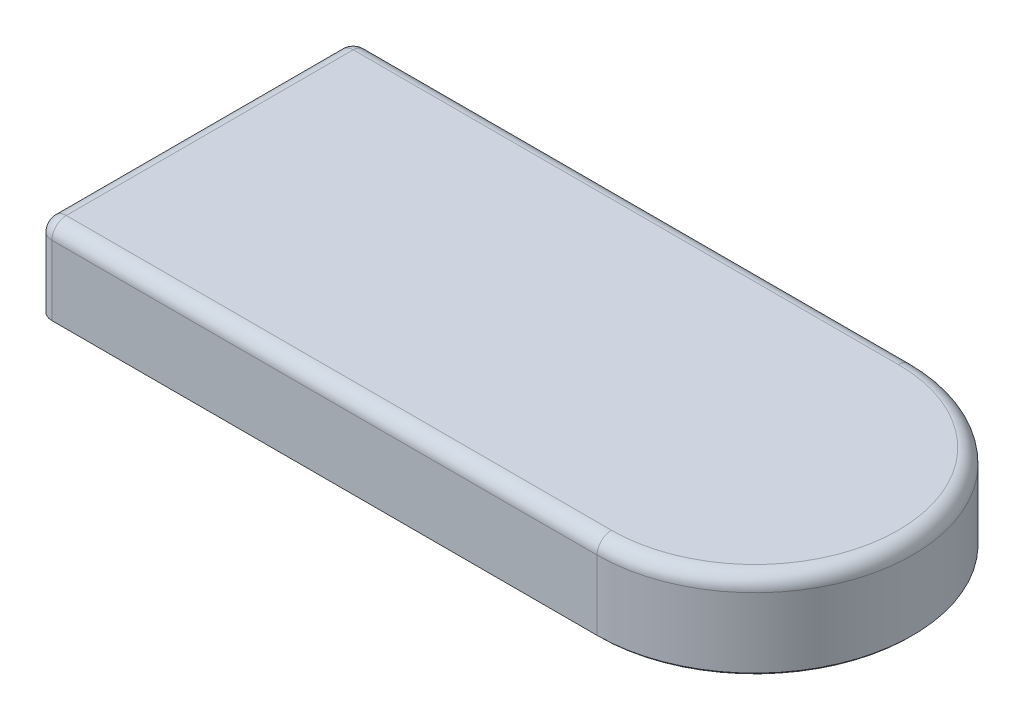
ISO-10303-21;
HEADER;
FILE_DESCRIPTION(('STEP AP214'),'2;1');
FILE_NAME('part.step','',(''),(''),'','','');
FILE_SCHEMA(('AUTOMOTIVE_DESIGN { 1 0 10303 214 1 1 1 1 }'));
ENDSEC;
DATA;
#1=APPLICATION_CONTEXT('core data for automotive mechanical design processes');
#2=APPLICATION_PROTOCOL_DEFINITION('international standard','automotive_design',2000,#1);
#3=PRODUCT_CONTEXT('',#1,'mechanical');
#4=PRODUCT('Part','Part','',(#3));
#5=PRODUCT_RELATED_PRODUCT_CATEGORY('part','',(#4));
#6=PRODUCT_DEFINITION_FORMATION('','',#4);
#7=PRODUCT_DEFINITION_CONTEXT('part definition',#1,'design');
#8=PRODUCT_DEFINITION('design','',#6,#7);
#9=PRODUCT_DEFINITION_SHAPE('','',#8);
#10=(LENGTH_UNIT() NAMED_UNIT(*) SI_UNIT(.MILLI.,.METRE.));
#11=(NAMED_UNIT(*) PLANE_ANGLE_UNIT() SI_UNIT($,.RADIAN.));
#12=(NAMED_UNIT(*) SI_UNIT($,.STERADIAN.) SOLID_ANGLE_UNIT());
#13=UNCERTAINTY_MEASURE_WITH_UNIT(LENGTH_MEASURE(1.E-05),#10,'distance_accuracy_value','');
#14=(GEOMETRIC_REPRESENTATION_CONTEXT(3) GLOBAL_UNCERTAINTY_ASSIGNED_CONTEXT((#13)) GLOBAL_UNIT_ASSIGNED_CONTEXT((#10,
#11,#12)) REPRESENTATION_CONTEXT('',''));
#15=CARTESIAN_POINT('',(0.,0.,0.));
#16=DIRECTION('',(0.,0.,1.));
#17=DIRECTION('',(1.,0.,0.));
#18=AXIS2_PLACEMENT_3D('',#15,#16,#17);
#19=CARTESIAN_POINT('',(78.,12.,-22.));
#20=DIRECTION('',(0.,-1.,0.));
#21=DIRECTION('',(0.,0.,-1.));
#22=AXIS2_PLACEMENT_3D('',#19,#20,#21);
#23=CYLINDRICAL_SURFACE('',#22,22.);
#24=DIRECTION('',(0.,-1.,0.));
#25=VECTOR('',#24,1.);
#26=CARTESIAN_POINT('',(78.,12.,0.));
#27=LINE('',#26,#25);
#28=CARTESIAN_POINT('',(78.,10.,0.));
#29=VERTEX_POINT('',#28);
#30=CARTESIAN_POINT('',(78.,0.299999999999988,0.));
#31=VERTEX_POINT('',#30);
#32=EDGE_CURVE('E187',#29,#31,#27,.T.);
#33=ORIENTED_EDGE('',*,*,#32,.T.);
#34=CARTESIAN_POINT('',(78.,0.299999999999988,-22.));
#35=DIRECTION('',(0.,-1.,0.));
#36=DIRECTION('',(0.,0.,-1.));
#37=AXIS2_PLACEMENT_3D('',#34,#35,#36);
#38=CIRCLE('',#37,22.);
#39=CARTESIAN_POINT('',(78.,0.299999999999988,-44.));
#40=VERTEX_POINT('',#39);
#41=EDGE_CURVE('E11',#31,#40,#38,.F.);
#42=ORIENTED_EDGE('',*,*,#41,.T.);
#43=DIRECTION('',(0.,-1.,0.));
#44=VECTOR('',#43,1.);
#45=CARTESIAN_POINT('',(78.,12.,-44.));
#46=LINE('',#45,#44);
#47=CARTESIAN_POINT('',(78.,10.,-44.));
#48=VERTEX_POINT('',#47);
#49=EDGE_CURVE('E154',#48,#40,#46,.T.);
#50=ORIENTED_EDGE('',*,*,#49,.F.);
#51=CARTESIAN_POINT('',(78.,10.,-22.));
#52=DIRECTION('',(0.,-1.,0.));
#53=DIRECTION('',(0.,0.,-1.));
#54=AXIS2_PLACEMENT_3D('',#51,#52,#53);
#55=CIRCLE('',#54,22.);
#56=EDGE_CURVE('E173',#48,#29,#55,.T.);
#57=ORIENTED_EDGE('',*,*,#56,.T.);
#58=EDGE_LOOP('',(#33,#42,#50,#57));
#59=FACE_BOUND('',#58,.T.);
#60=ADVANCED_FACE('F47',(#59),#23,.T.);
#61=CARTESIAN_POINT('',(2.00000000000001,12.,-44.));
#62=DIRECTION('',(0.,0.,1.));
#63=DIRECTION('',(1.,0.,0.));
#64=AXIS2_PLACEMENT_3D('',#61,#62,#63);
#65=PLANE('',#64);
#66=ORIENTED_EDGE('',*,*,#49,.T.);
#67=DIRECTION('',(-1.,0.,0.));
#68=VECTOR('',#67,1.);
#69=CARTESIAN_POINT('',(2.00000000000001,0.299999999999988,-44.));
#70=LINE('',#69,#68);
#71=CARTESIAN_POINT('',(2.00000000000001,0.299999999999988,-44.));
#72=VERTEX_POINT('',#71);
#73=EDGE_CURVE('E174',#40,#72,#70,.T.);
#74=ORIENTED_EDGE('',*,*,#73,.T.);
#75=DIRECTION('',(0.,-1.,0.));
#76=VECTOR('',#75,1.);
#77=CARTESIAN_POINT('',(2.00000000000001,12.,-44.));
#78=LINE('',#77,#76);
#79=CARTESIAN_POINT('',(2.00000000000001,10.,-44.));
#80=VERTEX_POINT('',#79);
#81=EDGE_CURVE('E250',#80,#72,#78,.T.);
#82=ORIENTED_EDGE('',*,*,#81,.F.);
#83=DIRECTION('',(-1.,0.,0.));
#84=VECTOR('',#83,1.);
#85=CARTESIAN_POINT('',(2.00000000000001,10.,-44.));
#86=LINE('',#85,#84);
#87=EDGE_CURVE('E171',#80,#48,#86,.F.);
#88=ORIENTED_EDGE('',*,*,#87,.T.);
#89=EDGE_LOOP('',(#66,#74,#82,#88));
#90=FACE_BOUND('',#89,.T.);
#91=ADVANCED_FACE('F246',(#90),#65,.F.);
#92=CARTESIAN_POINT('',(2.,12.,-42.));
#93=DIRECTION('',(0.,-1.,0.));
#94=DIRECTION('',(0.,0.,-1.));
#95=AXIS2_PLACEMENT_3D('',#92,#93,#94);
#96=CYLINDRICAL_SURFACE('',#95,2.);
#97=ORIENTED_EDGE('',*,*,#81,.T.);
#98=CARTESIAN_POINT('',(2.,0.299999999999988,-42.));
#99=DIRECTION('',(0.,-1.,0.));
#100=DIRECTION('',(0.,0.,-1.));
#101=AXIS2_PLACEMENT_3D('',#98,#99,#100);
#102=CIRCLE('',#101,2.);
#103=CARTESIAN_POINT('',(0.,0.299999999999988,-42.));
#104=VERTEX_POINT('',#103);
#105=EDGE_CURVE('E203',#72,#104,#102,.F.);
#106=ORIENTED_EDGE('',*,*,#105,.T.);
#107=DIRECTION('',(0.,-1.,0.));
#108=VECTOR('',#107,1.);
#109=CARTESIAN_POINT('',(0.,12.,-42.));
#110=LINE('',#109,#108);
#111=CARTESIAN_POINT('',(0.,10.,-42.));
#112=VERTEX_POINT('',#111);
#113=EDGE_CURVE('E252',#112,#104,#110,.T.);
#114=ORIENTED_EDGE('',*,*,#113,.F.);
#115=CARTESIAN_POINT('',(2.,10.,-42.));
#116=DIRECTION('',(0.,-1.,0.));
#117=DIRECTION('',(0.,0.,-1.));
#118=AXIS2_PLACEMENT_3D('',#115,#116,#117);
#119=CIRCLE('',#118,2.);
#120=EDGE_CURVE('E169',#112,#80,#119,.T.);
#121=ORIENTED_EDGE('',*,*,#120,.T.);
#122=EDGE_LOOP('',(#97,#106,#114,#121));
#123=FACE_BOUND('',#122,.T.);
#124=ADVANCED_FACE('F304',(#123),#96,.T.);
#125=CARTESIAN_POINT('',(0.,12.,-2.00000000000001));
#126=DIRECTION('',(1.,0.,0.));
#127=DIRECTION('',(0.,0.,-1.));
#128=AXIS2_PLACEMENT_3D('',#125,#126,#127);
#129=PLANE('',#128);
#130=ORIENTED_EDGE('',*,*,#113,.T.);
#131=DIRECTION('',(0.,0.,1.));
#132=VECTOR('',#131,1.);
#133=CARTESIAN_POINT('',(0.,0.299999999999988,-2.00000000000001));
#134=LINE('',#133,#132);
#135=CARTESIAN_POINT('',(0.,0.299999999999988,-2.00000000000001));
#136=VERTEX_POINT('',#135);
#137=EDGE_CURVE('E205',#104,#136,#134,.T.);
#138=ORIENTED_EDGE('',*,*,#137,.T.);
#139=DIRECTION('',(0.,-1.,0.));
#140=VECTOR('',#139,1.);
#141=CARTESIAN_POINT('',(0.,12.,-2.00000000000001));
#142=LINE('',#141,#140);
#143=CARTESIAN_POINT('',(0.,10.,-2.00000000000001));
#144=VERTEX_POINT('',#143);
#145=EDGE_CURVE('E273',#144,#136,#142,.T.);
#146=ORIENTED_EDGE('',*,*,#145,.F.);
#147=DIRECTION('',(0.,0.,1.));
#148=VECTOR('',#147,1.);
#149=CARTESIAN_POINT('',(0.,10.,-2.00000000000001));
#150=LINE('',#149,#148);
#151=EDGE_CURVE('E167',#144,#112,#150,.F.);
#152=ORIENTED_EDGE('',*,*,#151,.T.);
#153=EDGE_LOOP('',(#130,#138,#146,#152));
#154=FACE_BOUND('',#153,.T.);
#155=ADVANCED_FACE('F280',(#154),#129,.F.);
#156=CARTESIAN_POINT('',(2.,12.,-2.));
#157=DIRECTION('',(0.,-1.,0.));
#158=DIRECTION('',(0.,0.,-1.));
#159=AXIS2_PLACEMENT_3D('',#156,#157,#158);
#160=CYLINDRICAL_SURFACE('',#159,2.);
#161=ORIENTED_EDGE('',*,*,#145,.T.);
#162=CARTESIAN_POINT('',(2.,0.299999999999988,-2.));
#163=DIRECTION('',(0.,-1.,0.));
#164=DIRECTION('',(0.,0.,-1.));
#165=AXIS2_PLACEMENT_3D('',#162,#163,#164);
#166=CIRCLE('',#165,2.);
#167=CARTESIAN_POINT('',(2.00000000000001,0.299999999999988,0.));
#168=VERTEX_POINT('',#167);
#169=EDGE_CURVE('E72',#136,#168,#166,.F.);
#170=ORIENTED_EDGE('',*,*,#169,.T.);
#171=DIRECTION('',(0.,-1.,0.));
#172=VECTOR('',#171,1.);
#173=CARTESIAN_POINT('',(2.00000000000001,12.,0.));
#174=LINE('',#173,#172);
#175=CARTESIAN_POINT('',(2.00000000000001,10.,0.));
#176=VERTEX_POINT('',#175);
#177=EDGE_CURVE('E271',#176,#168,#174,.T.);
#178=ORIENTED_EDGE('',*,*,#177,.F.);
#179=CARTESIAN_POINT('',(2.,10.,-2.));
#180=DIRECTION('',(0.,-1.,0.));
#181=DIRECTION('',(0.,0.,-1.));
#182=AXIS2_PLACEMENT_3D('',#179,#180,#181);
#183=CIRCLE('',#182,2.);
#184=EDGE_CURVE('E161',#176,#144,#183,.T.);
#185=ORIENTED_EDGE('',*,*,#184,.T.);
#186=EDGE_LOOP('',(#161,#170,#178,#185));
#187=FACE_BOUND('',#186,.T.);
#188=ADVANCED_FACE('F272',(#187),#160,.T.);
#189=CARTESIAN_POINT('',(2.00000000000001,12.,0.));
#190=DIRECTION('',(0.,0.,-1.));
#191=DIRECTION('',(-1.,0.,0.));
#192=AXIS2_PLACEMENT_3D('',#189,#190,#191);
#193=PLANE('',#192);
#194=ORIENTED_EDGE('',*,*,#177,.T.);
#195=DIRECTION('',(1.,0.,0.));
#196=VECTOR('',#195,1.);
#197=CARTESIAN_POINT('',(78.,0.299999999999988,0.));
#198=LINE('',#197,#196);
#199=EDGE_CURVE('E57',#168,#31,#198,.T.);
#200=ORIENTED_EDGE('',*,*,#199,.T.);
#201=ORIENTED_EDGE('',*,*,#32,.F.);
#202=DIRECTION('',(1.,0.,0.));
#203=VECTOR('',#202,1.);
#204=CARTESIAN_POINT('',(2.00000000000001,10.,0.));
#205=LINE('',#204,#203);
#206=EDGE_CURVE('E141',#29,#176,#205,.F.);
#207=ORIENTED_EDGE('',*,*,#206,.T.);
#208=EDGE_LOOP('',(#194,#200,#201,#207));
#209=FACE_BOUND('',#208,.T.);
#210=ADVANCED_FACE('F270',(#209),#193,.F.);
#211=CARTESIAN_POINT('',(78.,12.,-22.));
#212=DIRECTION('',(0.,-1.,0.));
#213=DIRECTION('',(0.,0.,-1.));
#214=AXIS2_PLACEMENT_3D('',#211,#212,#213);
#215=PLANE('',#214);
#216=DIRECTION('',(0.,0.,1.));
#217=VECTOR('',#216,1.);
#218=CARTESIAN_POINT('',(2.,12.,-22.));
#219=LINE('',#218,#217);
#220=CARTESIAN_POINT('',(2.,12.,-42.));
#221=VERTEX_POINT('',#220);
#222=CARTESIAN_POINT('',(2.,12.,-2.));
#223=VERTEX_POINT('',#222);
#224=EDGE_CURVE('E158',#221,#223,#219,.T.);
#225=ORIENTED_EDGE('',*,*,#224,.T.);
#226=DIRECTION('',(1.,0.,0.));
#227=VECTOR('',#226,1.);
#228=CARTESIAN_POINT('',(78.,12.,-2.));
#229=LINE('',#228,#227);
#230=CARTESIAN_POINT('',(78.,12.,-2.));
#231=VERTEX_POINT('',#230);
#232=EDGE_CURVE('E139',#223,#231,#229,.T.);
#233=ORIENTED_EDGE('',*,*,#232,.T.);
#234=CARTESIAN_POINT('',(78.,12.,-22.));
#235=DIRECTION('',(0.,-1.,0.));
#236=DIRECTION('',(0.,0.,-1.));
#237=AXIS2_PLACEMENT_3D('',#234,#235,#236);
#238=CIRCLE('',#237,20.);
#239=CARTESIAN_POINT('',(78.,12.,-42.));
#240=VERTEX_POINT('',#239);
#241=EDGE_CURVE('E147',#231,#240,#238,.F.);
#242=ORIENTED_EDGE('',*,*,#241,.T.);
#243=DIRECTION('',(-1.,0.,0.));
#244=VECTOR('',#243,1.);
#245=CARTESIAN_POINT('',(78.,12.,-42.));
#246=LINE('',#245,#244);
#247=EDGE_CURVE('E153',#240,#221,#246,.T.);
#248=ORIENTED_EDGE('',*,*,#247,.T.);
#249=EDGE_LOOP('',(#225,#233,#242,#248));
#250=FACE_BOUND('',#249,.T.);
#251=ADVANCED_FACE('F156',(#250),#215,.F.);
#252=CARTESIAN_POINT('',(78.,0.,-22.));
#253=DIRECTION('',(0.,-1.,0.));
#254=DIRECTION('',(0.,0.,-1.));
#255=AXIS2_PLACEMENT_3D('',#252,#253,#254);
#256=PLANE('',#255);
#257=CARTESIAN_POINT('',(2.,0.,-42.));
#258=DIRECTION('',(0.,-1.,0.));
#259=DIRECTION('',(0.,0.,-1.));
#260=AXIS2_PLACEMENT_3D('',#257,#258,#259);
#261=CIRCLE('',#260,1.70000000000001);
#262=CARTESIAN_POINT('',(0.299999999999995,0.,-42.));
#263=VERTEX_POINT('',#262);
#264=CARTESIAN_POINT('',(2.00000000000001,0.,-43.7));
#265=VERTEX_POINT('',#264);
#266=EDGE_CURVE('E198',#263,#265,#261,.T.);
#267=ORIENTED_EDGE('',*,*,#266,.T.);
#268=DIRECTION('',(1.,0.,0.));
#269=VECTOR('',#268,1.);
#270=CARTESIAN_POINT('',(78.,0.,-43.7));
#271=LINE('',#270,#269);
#272=CARTESIAN_POINT('',(78.,0.,-43.7));
#273=VERTEX_POINT('',#272);
#274=EDGE_CURVE('E200',#265,#273,#271,.T.);
#275=ORIENTED_EDGE('',*,*,#274,.T.);
#276=CARTESIAN_POINT('',(78.,0.,-22.));
#277=DIRECTION('',(0.,-1.,0.));
#278=DIRECTION('',(0.,0.,-1.));
#279=AXIS2_PLACEMENT_3D('',#276,#277,#278);
#280=CIRCLE('',#279,21.7);
#281=CARTESIAN_POINT('',(78.,0.,-0.299999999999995));
#282=VERTEX_POINT('',#281);
#283=EDGE_CURVE('E190',#273,#282,#280,.T.);
#284=ORIENTED_EDGE('',*,*,#283,.T.);
#285=DIRECTION('',(-1.,0.,0.));
#286=VECTOR('',#285,1.);
#287=CARTESIAN_POINT('',(2.00000000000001,0.,-0.299999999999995));
#288=LINE('',#287,#286);
#289=CARTESIAN_POINT('',(2.00000000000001,0.,-0.299999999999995));
#290=VERTEX_POINT('',#289);
#291=EDGE_CURVE('E192',#282,#290,#288,.T.);
#292=ORIENTED_EDGE('',*,*,#291,.T.);
#293=CARTESIAN_POINT('',(2.,0.,-2.));
#294=DIRECTION('',(0.,-1.,0.));
#295=DIRECTION('',(0.,0.,-1.));
#296=AXIS2_PLACEMENT_3D('',#293,#294,#295);
#297=CIRCLE('',#296,1.70000000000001);
#298=CARTESIAN_POINT('',(0.299999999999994,0.,-2.00000000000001));
#299=VERTEX_POINT('',#298);
#300=EDGE_CURVE('E194',#290,#299,#297,.T.);
#301=ORIENTED_EDGE('',*,*,#300,.T.);
#302=DIRECTION('',(0.,0.,-1.));
#303=VECTOR('',#302,1.);
#304=CARTESIAN_POINT('',(0.299999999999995,0.,-42.));
#305=LINE('',#304,#303);
#306=EDGE_CURVE('E196',#299,#263,#305,.T.);
#307=ORIENTED_EDGE('',*,*,#306,.T.);
#308=EDGE_LOOP('',(#267,#275,#284,#292,#301,#307));
#309=FACE_BOUND('',#308,.T.);
#310=ADVANCED_FACE('F233',(#309),#256,.T.);
#311=CARTESIAN_POINT('',(2.,10.,-42.));
#312=DIRECTION('',(0.,-1.,0.));
#313=DIRECTION('',(0.,0.,-1.));
#314=AXIS2_PLACEMENT_3D('',#311,#312,#313);
#315=SPHERICAL_SURFACE('',#314,2.);
#316=CARTESIAN_POINT('',(2.,10.,-42.));
#317=DIRECTION('',(1.,0.,0.));
#318=DIRECTION('',(0.,0.,-1.));
#319=AXIS2_PLACEMENT_3D('',#316,#317,#318);
#320=CIRCLE('',#319,2.);
#321=EDGE_CURVE('E181',#80,#221,#320,.T.);
#322=ORIENTED_EDGE('',*,*,#321,.F.);
#323=ORIENTED_EDGE('',*,*,#120,.F.);
#324=CARTESIAN_POINT('',(2.,10.,-42.));
#325=DIRECTION('',(0.,0.,1.));
#326=DIRECTION('',(1.,0.,0.));
#327=AXIS2_PLACEMENT_3D('',#324,#325,#326);
#328=CIRCLE('',#327,2.);
#329=EDGE_CURVE('E184',#221,#112,#328,.T.);
#330=ORIENTED_EDGE('',*,*,#329,.F.);
#331=EDGE_LOOP('',(#322,#323,#330));
#332=FACE_BOUND('',#331,.T.);
#333=ADVANCED_FACE('F261',(#332),#315,.T.);
#334=CARTESIAN_POINT('',(2.,10.,-22.));
#335=DIRECTION('',(0.,0.,1.));
#336=DIRECTION('',(1.,0.,0.));
#337=AXIS2_PLACEMENT_3D('',#334,#335,#336);
#338=CYLINDRICAL_SURFACE('',#337,2.);
#339=ORIENTED_EDGE('',*,*,#329,.T.);
#340=ORIENTED_EDGE('',*,*,#151,.F.);
#341=CARTESIAN_POINT('',(2.,10.,-2.));
#342=DIRECTION('',(0.,0.,1.));
#343=DIRECTION('',(1.,0.,0.));
#344=AXIS2_PLACEMENT_3D('',#341,#342,#343);
#345=CIRCLE('',#344,2.);
#346=EDGE_CURVE('E178',#223,#144,#345,.T.);
#347=ORIENTED_EDGE('',*,*,#346,.F.);
#348=ORIENTED_EDGE('',*,*,#224,.F.);
#349=EDGE_LOOP('',(#339,#340,#347,#348));
#350=FACE_BOUND('',#349,.T.);
#351=ADVANCED_FACE('F264',(#350),#338,.T.);
#352=CARTESIAN_POINT('',(78.,10.,-42.));
#353=DIRECTION('',(-1.,0.,0.));
#354=DIRECTION('',(0.,0.,1.));
#355=AXIS2_PLACEMENT_3D('',#352,#353,#354);
#356=CYLINDRICAL_SURFACE('',#355,2.);
#357=ORIENTED_EDGE('',*,*,#321,.T.);
#358=ORIENTED_EDGE('',*,*,#247,.F.);
#359=CARTESIAN_POINT('',(78.,10.,-42.));
#360=DIRECTION('',(1.,0.,0.));
#361=DIRECTION('',(0.,0.,-1.));
#362=AXIS2_PLACEMENT_3D('',#359,#360,#361);
#363=CIRCLE('',#362,2.);
#364=EDGE_CURVE('E150',#48,#240,#363,.T.);
#365=ORIENTED_EDGE('',*,*,#364,.F.);
#366=ORIENTED_EDGE('',*,*,#87,.F.);
#367=EDGE_LOOP('',(#357,#358,#365,#366));
#368=FACE_BOUND('',#367,.T.);
#369=ADVANCED_FACE('F258',(#368),#356,.T.);
#370=CARTESIAN_POINT('',(2.,10.,-2.));
#371=DIRECTION('',(0.,-1.,0.));
#372=DIRECTION('',(0.,0.,-1.));
#373=AXIS2_PLACEMENT_3D('',#370,#371,#372);
#374=SPHERICAL_SURFACE('',#373,2.);
#375=ORIENTED_EDGE('',*,*,#346,.T.);
#376=ORIENTED_EDGE('',*,*,#184,.F.);
#377=CARTESIAN_POINT('',(2.,10.,-2.));
#378=DIRECTION('',(1.,0.,0.));
#379=DIRECTION('',(0.,0.,-1.));
#380=AXIS2_PLACEMENT_3D('',#377,#378,#379);
#381=CIRCLE('',#380,2.);
#382=EDGE_CURVE('E144',#223,#176,#381,.T.);
#383=ORIENTED_EDGE('',*,*,#382,.F.);
#384=EDGE_LOOP('',(#375,#376,#383));
#385=FACE_BOUND('',#384,.T.);
#386=ADVANCED_FACE('F268',(#385),#374,.T.);
#387=CARTESIAN_POINT('',(78.,10.,-22.));
#388=DIRECTION('',(0.,-1.,0.));
#389=DIRECTION('',(0.,0.,-1.));
#390=AXIS2_PLACEMENT_3D('',#387,#388,#389);
#391=TOROIDAL_SURFACE('',#390,20.,2.);
#392=ORIENTED_EDGE('',*,*,#364,.T.);
#393=ORIENTED_EDGE('',*,*,#241,.F.);
#394=CARTESIAN_POINT('',(78.,10.,-2.));
#395=DIRECTION('',(-1.,0.,0.));
#396=DIRECTION('',(0.,0.,1.));
#397=AXIS2_PLACEMENT_3D('',#394,#395,#396);
#398=CIRCLE('',#397,2.);
#399=EDGE_CURVE('E135',#29,#231,#398,.T.);
#400=ORIENTED_EDGE('',*,*,#399,.F.);
#401=ORIENTED_EDGE('',*,*,#56,.F.);
#402=EDGE_LOOP('',(#392,#393,#400,#401));
#403=FACE_BOUND('',#402,.T.);
#404=ADVANCED_FACE('F148',(#403),#391,.T.);
#405=CARTESIAN_POINT('',(78.,10.,-2.));
#406=DIRECTION('',(1.,0.,0.));
#407=DIRECTION('',(0.,0.,-1.));
#408=AXIS2_PLACEMENT_3D('',#405,#406,#407);
#409=CYLINDRICAL_SURFACE('',#408,2.);
#410=ORIENTED_EDGE('',*,*,#382,.T.);
#411=ORIENTED_EDGE('',*,*,#206,.F.);
#412=ORIENTED_EDGE('',*,*,#399,.T.);
#413=ORIENTED_EDGE('',*,*,#232,.F.);
#414=EDGE_LOOP('',(#410,#411,#412,#413));
#415=FACE_BOUND('',#414,.T.);
#416=ADVANCED_FACE('F137',(#415),#409,.T.);
#417=CARTESIAN_POINT('',(2.,0.299999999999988,-2.));
#418=DIRECTION('',(0.,1.,0.));
#419=DIRECTION('',(0.,0.,1.));
#420=AXIS2_PLACEMENT_3D('',#417,#418,#419);
#421=CONICAL_SURFACE('',#420,2.,0.78539816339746);
#422=DIRECTION('',(-0.707106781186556,0.707106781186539,0.));
#423=VECTOR('',#422,1.);
#424=CARTESIAN_POINT('',(0.299999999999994,0.,-2.00000000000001));
#425=LINE('',#424,#423);
#426=EDGE_CURVE('E218',#299,#136,#425,.T.);
#427=ORIENTED_EDGE('',*,*,#426,.F.);
#428=ORIENTED_EDGE('',*,*,#300,.F.);
#429=DIRECTION('',(0.,-0.707106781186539,-0.707106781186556));
#430=VECTOR('',#429,1.);
#431=CARTESIAN_POINT('',(2.00000000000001,0.299999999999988,0.));
#432=LINE('',#431,#430);
#433=EDGE_CURVE('E52',#168,#290,#432,.T.);
#434=ORIENTED_EDGE('',*,*,#433,.F.);
#435=ORIENTED_EDGE('',*,*,#169,.F.);
#436=EDGE_LOOP('',(#427,#428,#434,#435));
#437=FACE_BOUND('',#436,.T.);
#438=ADVANCED_FACE('F50',(#437),#421,.T.);
#439=CARTESIAN_POINT('',(2.00000000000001,0.299999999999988,0.));
#440=DIRECTION('',(0.,-0.707106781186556,0.707106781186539));
#441=DIRECTION('',(-1.,0.,0.));
#442=AXIS2_PLACEMENT_3D('',#439,#440,#441);
#443=PLANE('',#442);
#444=ORIENTED_EDGE('',*,*,#433,.T.);
#445=ORIENTED_EDGE('',*,*,#291,.F.);
#446=DIRECTION('',(0.,-0.707106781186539,-0.707106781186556));
#447=VECTOR('',#446,1.);
#448=CARTESIAN_POINT('',(78.,0.299999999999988,0.));
#449=LINE('',#448,#447);
#450=EDGE_CURVE('E216',#31,#282,#449,.T.);
#451=ORIENTED_EDGE('',*,*,#450,.F.);
#452=ORIENTED_EDGE('',*,*,#199,.F.);
#453=EDGE_LOOP('',(#444,#445,#451,#452));
#454=FACE_BOUND('',#453,.T.);
#455=ADVANCED_FACE('F228',(#454),#443,.T.);
#456=CARTESIAN_POINT('',(0.,0.299999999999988,-2.00000000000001));
#457=DIRECTION('',(-0.707106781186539,-0.707106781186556,0.));
#458=DIRECTION('',(0.,0.,-1.));
#459=AXIS2_PLACEMENT_3D('',#456,#457,#458);
#460=PLANE('',#459);
#461=ORIENTED_EDGE('',*,*,#426,.T.);
#462=ORIENTED_EDGE('',*,*,#137,.F.);
#463=DIRECTION('',(-0.707106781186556,0.707106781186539,0.));
#464=VECTOR('',#463,1.);
#465=CARTESIAN_POINT('',(0.299999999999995,0.,-42.));
#466=LINE('',#465,#464);
#467=EDGE_CURVE('E213',#263,#104,#466,.T.);
#468=ORIENTED_EDGE('',*,*,#467,.F.);
#469=ORIENTED_EDGE('',*,*,#306,.F.);
#470=EDGE_LOOP('',(#461,#462,#468,#469));
#471=FACE_BOUND('',#470,.T.);
#472=ADVANCED_FACE('F282',(#471),#460,.T.);
#473=CARTESIAN_POINT('',(78.,0.299999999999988,-22.));
#474=DIRECTION('',(0.,1.,0.));
#475=DIRECTION('',(0.,0.,1.));
#476=AXIS2_PLACEMENT_3D('',#473,#474,#475);
#477=CONICAL_SURFACE('',#476,22.,0.78539816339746);
#478=ORIENTED_EDGE('',*,*,#450,.T.);
#479=ORIENTED_EDGE('',*,*,#283,.F.);
#480=DIRECTION('',(0.,-0.707106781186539,0.707106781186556));
#481=VECTOR('',#480,1.);
#482=CARTESIAN_POINT('',(78.,0.299999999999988,-44.));
#483=LINE('',#482,#481);
#484=EDGE_CURVE('E211',#40,#273,#483,.T.);
#485=ORIENTED_EDGE('',*,*,#484,.F.);
#486=ORIENTED_EDGE('',*,*,#41,.F.);
#487=EDGE_LOOP('',(#478,#479,#485,#486));
#488=FACE_BOUND('',#487,.T.);
#489=ADVANCED_FACE('F239',(#488),#477,.T.);
#490=CARTESIAN_POINT('',(2.,0.299999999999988,-42.));
#491=DIRECTION('',(0.,1.,0.));
#492=DIRECTION('',(0.,0.,1.));
#493=AXIS2_PLACEMENT_3D('',#490,#491,#492);
#494=CONICAL_SURFACE('',#493,2.,0.78539816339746);
#495=ORIENTED_EDGE('',*,*,#467,.T.);
#496=ORIENTED_EDGE('',*,*,#105,.F.);
#497=DIRECTION('',(0.,0.707106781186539,-0.707106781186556));
#498=VECTOR('',#497,1.);
#499=CARTESIAN_POINT('',(2.00000000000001,0.,-43.7));
#500=LINE('',#499,#498);
#501=EDGE_CURVE('E209',#265,#72,#500,.T.);
#502=ORIENTED_EDGE('',*,*,#501,.F.);
#503=ORIENTED_EDGE('',*,*,#266,.F.);
#504=EDGE_LOOP('',(#495,#496,#502,#503));
#505=FACE_BOUND('',#504,.T.);
#506=ADVANCED_FACE('F286',(#505),#494,.T.);
#507=CARTESIAN_POINT('',(2.00000000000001,0.299999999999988,-44.));
#508=DIRECTION('',(0.,-0.707106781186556,-0.707106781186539));
#509=DIRECTION('',(1.,0.,0.));
#510=AXIS2_PLACEMENT_3D('',#507,#508,#509);
#511=PLANE('',#510);
#512=ORIENTED_EDGE('',*,*,#484,.T.);
#513=ORIENTED_EDGE('',*,*,#274,.F.);
#514=ORIENTED_EDGE('',*,*,#501,.T.);
#515=ORIENTED_EDGE('',*,*,#73,.F.);
#516=EDGE_LOOP('',(#512,#513,#514,#515));
#517=FACE_BOUND('',#516,.T.);
#518=ADVANCED_FACE('F289',(#517),#511,.T.);
#519=CLOSED_SHELL('',(#60,#91,#124,#155,#188,#210,#251,#310,#333,#351,#369,#386,#404,#416,#438,
#455,#472,#489,#506,#518));
#520=MANIFOLD_SOLID_BREP('B2',#519);
#521=ADVANCED_BREP_SHAPE_REPRESENTATION('',(#18,#520),#14);
#522=SHAPE_DEFINITION_REPRESENTATION(#9,#521);
ENDSEC;
END-ISO-10303-21;
